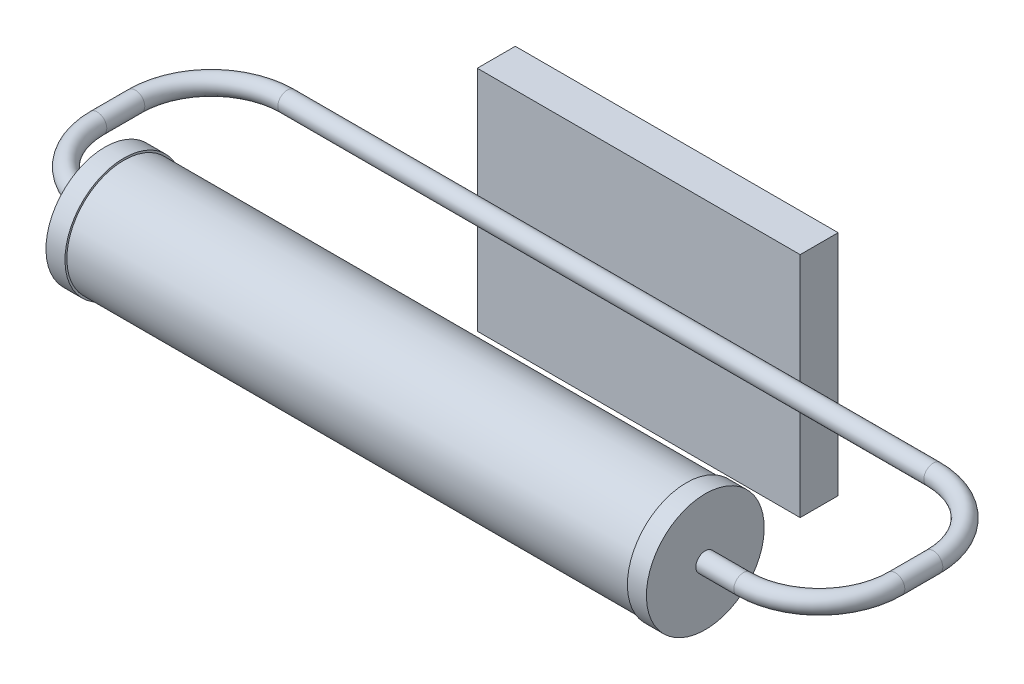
ISO-10303-21;
HEADER;
FILE_DESCRIPTION(('STEP AP214'),'2;1');
FILE_NAME('part.step','',(''),(''),'','','');
FILE_SCHEMA(('AUTOMOTIVE_DESIGN { 1 0 10303 214 1 1 1 1 }'));
ENDSEC;
DATA;
#1=APPLICATION_CONTEXT('core data for automotive mechanical design processes');
#2=APPLICATION_PROTOCOL_DEFINITION('international standard','automotive_design',2000,#1);
#3=PRODUCT_CONTEXT('',#1,'mechanical');
#4=PRODUCT('Part','Part','',(#3));
#5=PRODUCT_RELATED_PRODUCT_CATEGORY('part','',(#4));
#6=PRODUCT_DEFINITION_FORMATION('','',#4);
#7=PRODUCT_DEFINITION_CONTEXT('part definition',#1,'design');
#8=PRODUCT_DEFINITION('design','',#6,#7);
#9=PRODUCT_DEFINITION_SHAPE('','',#8);
#10=(LENGTH_UNIT() NAMED_UNIT(*) SI_UNIT(.MILLI.,.METRE.));
#11=(NAMED_UNIT(*) PLANE_ANGLE_UNIT() SI_UNIT($,.RADIAN.));
#12=(NAMED_UNIT(*) SI_UNIT($,.STERADIAN.) SOLID_ANGLE_UNIT());
#13=UNCERTAINTY_MEASURE_WITH_UNIT(LENGTH_MEASURE(1.E-05),#10,'distance_accuracy_value','');
#14=(GEOMETRIC_REPRESENTATION_CONTEXT(3) GLOBAL_UNCERTAINTY_ASSIGNED_CONTEXT((#13)) GLOBAL_UNIT_ASSIGNED_CONTEXT((#10,
#11,#12)) REPRESENTATION_CONTEXT('',''));
#15=CARTESIAN_POINT('',(0.,0.,0.));
#16=DIRECTION('',(0.,0.,1.));
#17=DIRECTION('',(1.,0.,0.));
#18=AXIS2_PLACEMENT_3D('',#15,#16,#17);
#19=CARTESIAN_POINT('',(-31.,59.944,-125.));
#20=DIRECTION('',(1.,0.,0.));
#21=DIRECTION('',(0.,1.,0.));
#22=AXIS2_PLACEMENT_3D('',#19,#20,#21);
#23=PLANE('',#22);
#24=DIRECTION('',(0.,1.,0.));
#25=VECTOR('',#24,1.);
#26=CARTESIAN_POINT('',(-31.,59.944,-105.));
#27=LINE('',#26,#25);
#28=CARTESIAN_POINT('',(-31.,-59.944,-105.));
#29=VERTEX_POINT('',#28);
#30=CARTESIAN_POINT('',(-31.,59.944,-105.));
#31=VERTEX_POINT('',#30);
#32=EDGE_CURVE('E192',#29,#31,#27,.T.);
#33=ORIENTED_EDGE('',*,*,#32,.T.);
#34=DIRECTION('',(0.,0.,1.));
#35=VECTOR('',#34,1.);
#36=CARTESIAN_POINT('',(-31.,59.944,-125.));
#37=LINE('',#36,#35);
#38=CARTESIAN_POINT('',(-31.,59.944,-125.));
#39=VERTEX_POINT('',#38);
#40=EDGE_CURVE('E13',#39,#31,#37,.T.);
#41=ORIENTED_EDGE('',*,*,#40,.F.);
#42=DIRECTION('',(0.,1.,0.));
#43=VECTOR('',#42,1.);
#44=CARTESIAN_POINT('',(-31.,59.944,-125.));
#45=LINE('',#44,#43);
#46=CARTESIAN_POINT('',(-31.,-59.944,-125.));
#47=VERTEX_POINT('',#46);
#48=EDGE_CURVE('E185',#47,#39,#45,.T.);
#49=ORIENTED_EDGE('',*,*,#48,.F.);
#50=DIRECTION('',(0.,0.,1.));
#51=VECTOR('',#50,1.);
#52=CARTESIAN_POINT('',(-31.,-59.944,-125.));
#53=LINE('',#52,#51);
#54=EDGE_CURVE('E191',#47,#29,#53,.T.);
#55=ORIENTED_EDGE('',*,*,#54,.T.);
#56=EDGE_LOOP('',(#33,#41,#49,#55));
#57=FACE_BOUND('',#56,.T.);
#58=ADVANCED_FACE('F78',(#57),#23,.F.);
#59=CARTESIAN_POINT('',(138.926,59.944,-125.));
#60=DIRECTION('',(0.,-1.,0.));
#61=DIRECTION('',(0.,0.,-1.));
#62=AXIS2_PLACEMENT_3D('',#59,#60,#61);
#63=PLANE('',#62);
#64=DIRECTION('',(1.,0.,0.));
#65=VECTOR('',#64,1.);
#66=CARTESIAN_POINT('',(138.926,59.944,-105.));
#67=LINE('',#66,#65);
#68=CARTESIAN_POINT('',(138.926,59.944,-105.));
#69=VERTEX_POINT('',#68);
#70=EDGE_CURVE('E195',#31,#69,#67,.T.);
#71=ORIENTED_EDGE('',*,*,#70,.T.);
#72=DIRECTION('',(0.,0.,1.));
#73=VECTOR('',#72,1.);
#74=CARTESIAN_POINT('',(138.926,59.944,-125.));
#75=LINE('',#74,#73);
#76=CARTESIAN_POINT('',(138.926,59.944,-125.));
#77=VERTEX_POINT('',#76);
#78=EDGE_CURVE('E85',#77,#69,#75,.T.);
#79=ORIENTED_EDGE('',*,*,#78,.F.);
#80=DIRECTION('',(1.,0.,0.));
#81=VECTOR('',#80,1.);
#82=CARTESIAN_POINT('',(138.926,59.944,-125.));
#83=LINE('',#82,#81);
#84=EDGE_CURVE('E129',#39,#77,#83,.T.);
#85=ORIENTED_EDGE('',*,*,#84,.F.);
#86=ORIENTED_EDGE('',*,*,#40,.T.);
#87=EDGE_LOOP('',(#71,#79,#85,#86));
#88=FACE_BOUND('',#87,.T.);
#89=ADVANCED_FACE('F224',(#88),#63,.F.);
#90=CARTESIAN_POINT('',(138.926,59.944,-125.));
#91=DIRECTION('',(-1.,0.,0.));
#92=DIRECTION('',(0.,0.,1.));
#93=AXIS2_PLACEMENT_3D('',#90,#91,#92);
#94=PLANE('',#93);
#95=DIRECTION('',(0.,-1.,0.));
#96=VECTOR('',#95,1.);
#97=CARTESIAN_POINT('',(138.926,59.944,-105.));
#98=LINE('',#97,#96);
#99=CARTESIAN_POINT('',(138.926,-59.944,-105.));
#100=VERTEX_POINT('',#99);
#101=EDGE_CURVE('E197',#69,#100,#98,.T.);
#102=ORIENTED_EDGE('',*,*,#101,.T.);
#103=DIRECTION('',(0.,0.,1.));
#104=VECTOR('',#103,1.);
#105=CARTESIAN_POINT('',(138.926,-59.944,-125.));
#106=LINE('',#105,#104);
#107=CARTESIAN_POINT('',(138.926,-59.944,-125.));
#108=VERTEX_POINT('',#107);
#109=EDGE_CURVE('E201',#108,#100,#106,.T.);
#110=ORIENTED_EDGE('',*,*,#109,.F.);
#111=DIRECTION('',(0.,-1.,0.));
#112=VECTOR('',#111,1.);
#113=CARTESIAN_POINT('',(138.926,59.944,-125.));
#114=LINE('',#113,#112);
#115=EDGE_CURVE('E188',#77,#108,#114,.T.);
#116=ORIENTED_EDGE('',*,*,#115,.F.);
#117=ORIENTED_EDGE('',*,*,#78,.T.);
#118=EDGE_LOOP('',(#102,#110,#116,#117));
#119=FACE_BOUND('',#118,.T.);
#120=ADVANCED_FACE('F206',(#119),#94,.F.);
#121=CARTESIAN_POINT('',(138.926,-59.944,-125.));
#122=DIRECTION('',(0.,1.,0.));
#123=DIRECTION('',(0.,0.,1.));
#124=AXIS2_PLACEMENT_3D('',#121,#122,#123);
#125=PLANE('',#124);
#126=DIRECTION('',(-1.,0.,0.));
#127=VECTOR('',#126,1.);
#128=CARTESIAN_POINT('',(138.926,-59.944,-105.));
#129=LINE('',#128,#127);
#130=EDGE_CURVE('E122',#100,#29,#129,.T.);
#131=ORIENTED_EDGE('',*,*,#130,.T.);
#132=ORIENTED_EDGE('',*,*,#54,.F.);
#133=DIRECTION('',(-1.,0.,0.));
#134=VECTOR('',#133,1.);
#135=CARTESIAN_POINT('',(138.926,-59.944,-125.));
#136=LINE('',#135,#134);
#137=EDGE_CURVE('E101',#108,#47,#136,.T.);
#138=ORIENTED_EDGE('',*,*,#137,.F.);
#139=ORIENTED_EDGE('',*,*,#109,.T.);
#140=EDGE_LOOP('',(#131,#132,#138,#139));
#141=FACE_BOUND('',#140,.T.);
#142=ADVANCED_FACE('F214',(#141),#125,.F.);
#143=CARTESIAN_POINT('',(0.,0.,-125.));
#144=DIRECTION('',(0.,0.,-1.));
#145=DIRECTION('',(-1.,0.,0.));
#146=AXIS2_PLACEMENT_3D('',#143,#144,#145);
#147=PLANE('',#146);
#148=DIRECTION('',(0.,1.,0.));
#149=VECTOR('',#148,1.);
#150=CARTESIAN_POINT('',(-30.,59.944,-125.));
#151=LINE('',#150,#149);
#152=CARTESIAN_POINT('',(-30.,-58.944,-125.));
#153=VERTEX_POINT('',#152);
#154=CARTESIAN_POINT('',(-30.,58.944,-125.));
#155=VERTEX_POINT('',#154);
#156=EDGE_CURVE('E174',#153,#155,#151,.T.);
#157=ORIENTED_EDGE('',*,*,#156,.F.);
#158=DIRECTION('',(-1.,0.,0.));
#159=VECTOR('',#158,1.);
#160=CARTESIAN_POINT('',(138.926,-58.944,-125.));
#161=LINE('',#160,#159);
#162=CARTESIAN_POINT('',(137.926,-58.944,-125.));
#163=VERTEX_POINT('',#162);
#164=EDGE_CURVE('E183',#163,#153,#161,.T.);
#165=ORIENTED_EDGE('',*,*,#164,.F.);
#166=DIRECTION('',(0.,-1.,0.));
#167=VECTOR('',#166,1.);
#168=CARTESIAN_POINT('',(137.926,59.944,-125.));
#169=LINE('',#168,#167);
#170=CARTESIAN_POINT('',(137.926,58.944,-125.));
#171=VERTEX_POINT('',#170);
#172=EDGE_CURVE('E181',#171,#163,#169,.T.);
#173=ORIENTED_EDGE('',*,*,#172,.F.);
#174=DIRECTION('',(1.,0.,0.));
#175=VECTOR('',#174,1.);
#176=CARTESIAN_POINT('',(138.926,58.944,-125.));
#177=LINE('',#176,#175);
#178=EDGE_CURVE('E166',#155,#171,#177,.T.);
#179=ORIENTED_EDGE('',*,*,#178,.F.);
#180=EDGE_LOOP('',(#157,#165,#173,#179));
#181=FACE_BOUND('',#180,.T.);
#182=ORIENTED_EDGE('',*,*,#48,.T.);
#183=ORIENTED_EDGE('',*,*,#84,.T.);
#184=ORIENTED_EDGE('',*,*,#115,.T.);
#185=ORIENTED_EDGE('',*,*,#137,.T.);
#186=EDGE_LOOP('',(#182,#183,#184,#185));
#187=FACE_BOUND('',#186,.T.);
#188=ADVANCED_FACE('F216',(#181,#187),#147,.T.);
#189=CARTESIAN_POINT('',(0.,0.,-105.));
#190=DIRECTION('',(0.,0.,-1.));
#191=DIRECTION('',(-1.,0.,0.));
#192=AXIS2_PLACEMENT_3D('',#189,#190,#191);
#193=PLANE('',#192);
#194=ORIENTED_EDGE('',*,*,#32,.F.);
#195=ORIENTED_EDGE('',*,*,#130,.F.);
#196=ORIENTED_EDGE('',*,*,#101,.F.);
#197=ORIENTED_EDGE('',*,*,#70,.F.);
#198=EDGE_LOOP('',(#194,#195,#196,#197));
#199=FACE_BOUND('',#198,.T.);
#200=ADVANCED_FACE('F210',(#199),#193,.F.);
#201=CARTESIAN_POINT('',(-30.,59.944,-125.));
#202=DIRECTION('',(1.,0.,0.));
#203=DIRECTION('',(0.,1.,0.));
#204=AXIS2_PLACEMENT_3D('',#201,#202,#203);
#205=PLANE('',#204);
#206=DIRECTION('',(0.,1.,0.));
#207=VECTOR('',#206,1.);
#208=CARTESIAN_POINT('',(-30.,59.944,-106.));
#209=LINE('',#208,#207);
#210=CARTESIAN_POINT('',(-30.,-58.944,-106.));
#211=VERTEX_POINT('',#210);
#212=CARTESIAN_POINT('',(-30.,58.944,-106.));
#213=VERTEX_POINT('',#212);
#214=EDGE_CURVE('E157',#211,#213,#209,.T.);
#215=ORIENTED_EDGE('',*,*,#214,.F.);
#216=DIRECTION('',(0.,0.,1.));
#217=VECTOR('',#216,1.);
#218=CARTESIAN_POINT('',(-30.,-58.944,-125.));
#219=LINE('',#218,#217);
#220=EDGE_CURVE('E177',#153,#211,#219,.T.);
#221=ORIENTED_EDGE('',*,*,#220,.F.);
#222=ORIENTED_EDGE('',*,*,#156,.T.);
#223=DIRECTION('',(0.,0.,1.));
#224=VECTOR('',#223,1.);
#225=CARTESIAN_POINT('',(-30.,58.944,-125.));
#226=LINE('',#225,#224);
#227=EDGE_CURVE('E169',#155,#213,#226,.T.);
#228=ORIENTED_EDGE('',*,*,#227,.T.);
#229=EDGE_LOOP('',(#215,#221,#222,#228));
#230=FACE_BOUND('',#229,.T.);
#231=ADVANCED_FACE('F253',(#230),#205,.T.);
#232=CARTESIAN_POINT('',(138.926,58.944,-125.));
#233=DIRECTION('',(0.,-1.,0.));
#234=DIRECTION('',(0.,0.,-1.));
#235=AXIS2_PLACEMENT_3D('',#232,#233,#234);
#236=PLANE('',#235);
#237=DIRECTION('',(1.,0.,0.));
#238=VECTOR('',#237,1.);
#239=CARTESIAN_POINT('',(138.926,58.944,-106.));
#240=LINE('',#239,#238);
#241=CARTESIAN_POINT('',(137.926,58.944,-106.));
#242=VERTEX_POINT('',#241);
#243=EDGE_CURVE('E151',#213,#242,#240,.T.);
#244=ORIENTED_EDGE('',*,*,#243,.F.);
#245=ORIENTED_EDGE('',*,*,#227,.F.);
#246=ORIENTED_EDGE('',*,*,#178,.T.);
#247=DIRECTION('',(0.,0.,1.));
#248=VECTOR('',#247,1.);
#249=CARTESIAN_POINT('',(137.926,58.944,-125.));
#250=LINE('',#249,#248);
#251=EDGE_CURVE('E163',#171,#242,#250,.T.);
#252=ORIENTED_EDGE('',*,*,#251,.T.);
#253=EDGE_LOOP('',(#244,#245,#246,#252));
#254=FACE_BOUND('',#253,.T.);
#255=ADVANCED_FACE('F164',(#254),#236,.T.);
#256=CARTESIAN_POINT('',(137.926,59.944,-125.));
#257=DIRECTION('',(-1.,0.,0.));
#258=DIRECTION('',(0.,0.,1.));
#259=AXIS2_PLACEMENT_3D('',#256,#257,#258);
#260=PLANE('',#259);
#261=DIRECTION('',(0.,-1.,0.));
#262=VECTOR('',#261,1.);
#263=CARTESIAN_POINT('',(137.926,59.944,-106.));
#264=LINE('',#263,#262);
#265=CARTESIAN_POINT('',(137.926,-58.944,-106.));
#266=VERTEX_POINT('',#265);
#267=EDGE_CURVE('E155',#242,#266,#264,.T.);
#268=ORIENTED_EDGE('',*,*,#267,.F.);
#269=ORIENTED_EDGE('',*,*,#251,.F.);
#270=ORIENTED_EDGE('',*,*,#172,.T.);
#271=DIRECTION('',(0.,0.,1.));
#272=VECTOR('',#271,1.);
#273=CARTESIAN_POINT('',(137.926,-58.944,-125.));
#274=LINE('',#273,#272);
#275=EDGE_CURVE('E92',#163,#266,#274,.T.);
#276=ORIENTED_EDGE('',*,*,#275,.T.);
#277=EDGE_LOOP('',(#268,#269,#270,#276));
#278=FACE_BOUND('',#277,.T.);
#279=ADVANCED_FACE('F171',(#278),#260,.T.);
#280=CARTESIAN_POINT('',(138.926,-58.944,-125.));
#281=DIRECTION('',(0.,1.,0.));
#282=DIRECTION('',(0.,0.,1.));
#283=AXIS2_PLACEMENT_3D('',#280,#281,#282);
#284=PLANE('',#283);
#285=DIRECTION('',(-1.,0.,0.));
#286=VECTOR('',#285,1.);
#287=CARTESIAN_POINT('',(138.926,-58.944,-106.));
#288=LINE('',#287,#286);
#289=EDGE_CURVE('E172',#266,#211,#288,.T.);
#290=ORIENTED_EDGE('',*,*,#289,.F.);
#291=ORIENTED_EDGE('',*,*,#275,.F.);
#292=ORIENTED_EDGE('',*,*,#164,.T.);
#293=ORIENTED_EDGE('',*,*,#220,.T.);
#294=EDGE_LOOP('',(#290,#291,#292,#293));
#295=FACE_BOUND('',#294,.T.);
#296=ADVANCED_FACE('F287',(#295),#284,.T.);
#297=CARTESIAN_POINT('',(0.,0.,-106.));
#298=DIRECTION('',(0.,0.,-1.));
#299=DIRECTION('',(-1.,0.,0.));
#300=AXIS2_PLACEMENT_3D('',#297,#298,#299);
#301=PLANE('',#300);
#302=ORIENTED_EDGE('',*,*,#214,.T.);
#303=ORIENTED_EDGE('',*,*,#243,.T.);
#304=ORIENTED_EDGE('',*,*,#267,.T.);
#305=ORIENTED_EDGE('',*,*,#289,.T.);
#306=EDGE_LOOP('',(#302,#303,#304,#305));
#307=FACE_BOUND('',#306,.T.);
#308=ADVANCED_FACE('F153',(#307),#301,.T.);
#309=CLOSED_SHELL('',(#58,#89,#120,#142,#188,#200,#231,#255,#279,#296,#308));
#310=MANIFOLD_SOLID_BREP('B2',#309);
#311=CARTESIAN_POINT('',(194.,0.,0.));
#312=DIRECTION('',(-1.,0.,0.));
#313=DIRECTION('',(0.,0.,1.));
#314=AXIS2_PLACEMENT_3D('',#311,#312,#313);
#315=PLANE('',#314);
#316=CARTESIAN_POINT('',(194.,0.,0.));
#317=DIRECTION('',(-1.,0.,0.));
#318=DIRECTION('',(0.,0.,1.));
#319=AXIS2_PLACEMENT_3D('',#316,#317,#318);
#320=CIRCLE('',#319,5.);
#321=CARTESIAN_POINT('',(194.,0.,5.));
#322=VERTEX_POINT('',#321);
#323=EDGE_CURVE('E359',#322,#322,#320,.T.);
#324=ORIENTED_EDGE('',*,*,#323,.T.);
#325=EDGE_LOOP('',(#324));
#326=FACE_BOUND('',#325,.T.);
#327=ADVANCED_FACE('F347',(#326),#315,.T.);
#328=CARTESIAN_POINT('',(-122.,0.,0.));
#329=DIRECTION('',(-1.,0.,0.));
#330=DIRECTION('',(0.,0.,1.));
#331=AXIS2_PLACEMENT_3D('',#328,#329,#330);
#332=PLANE('',#331);
#333=CARTESIAN_POINT('',(-122.,0.,0.));
#334=DIRECTION('',(-1.,0.,0.));
#335=DIRECTION('',(0.,0.,1.));
#336=AXIS2_PLACEMENT_3D('',#333,#334,#335);
#337=CIRCLE('',#336,5.);
#338=CARTESIAN_POINT('',(-122.,0.,5.));
#339=VERTEX_POINT('',#338);
#340=EDGE_CURVE('E76',#339,#339,#337,.T.);
#341=ORIENTED_EDGE('',*,*,#340,.F.);
#342=EDGE_LOOP('',(#341));
#343=FACE_BOUND('',#342,.T.);
#344=ADVANCED_FACE('F365',(#343),#332,.F.);
#345=CARTESIAN_POINT('',(194.,0.,0.));
#346=DIRECTION('',(1.,0.,0.));
#347=DIRECTION('',(0.,0.,-1.));
#348=AXIS2_PLACEMENT_3D('',#345,#346,#347);
#349=CYLINDRICAL_SURFACE('',#348,5.);
#350=CARTESIAN_POINT('',(214.,0.,0.));
#351=DIRECTION('',(-1.,0.,0.));
#352=DIRECTION('',(0.,0.,1.));
#353=AXIS2_PLACEMENT_3D('',#350,#351,#352);
#354=CIRCLE('',#353,5.);
#355=CARTESIAN_POINT('',(214.,0.,5.));
#356=VERTEX_POINT('',#355);
#357=EDGE_CURVE('E415',#356,#356,#354,.T.);
#358=ORIENTED_EDGE('',*,*,#357,.T.);
#359=EDGE_LOOP('',(#358));
#360=FACE_BOUND('',#359,.T.);
#361=ORIENTED_EDGE('',*,*,#323,.F.);
#362=EDGE_LOOP('',(#361));
#363=FACE_BOUND('',#362,.T.);
#364=ADVANCED_FACE('F367',(#360,#363),#349,.T.);
#365=CARTESIAN_POINT('',(214.,0.,-40.));
#366=DIRECTION('',(0.,1.,0.));
#367=DIRECTION('',(0.,0.,1.));
#368=AXIS2_PLACEMENT_3D('',#365,#366,#367);
#369=TOROIDAL_SURFACE('',#368,40.,5.);
#370=CARTESIAN_POINT('',(254.,0.,-40.));
#371=DIRECTION('',(0.,0.,1.));
#372=DIRECTION('',(1.,0.,0.));
#373=AXIS2_PLACEMENT_3D('',#370,#371,#372);
#374=CIRCLE('',#373,5.);
#375=CARTESIAN_POINT('',(259.,0.,-40.));
#376=VERTEX_POINT('',#375);
#377=EDGE_CURVE('E412',#376,#376,#374,.T.);
#378=CARTESIAN_POINT('',(214.,0.,-40.));
#379=DIRECTION('',(0.,1.,0.));
#380=DIRECTION('',(0.,0.,1.));
#381=AXIS2_PLACEMENT_3D('',#378,#379,#380);
#382=CIRCLE('',#381,45.);
#383=EDGE_CURVE('',#356,#376,#382,.T.);
#384=ORIENTED_EDGE('',*,*,#357,.F.);
#385=ORIENTED_EDGE('',*,*,#377,.T.);
#386=ORIENTED_EDGE('',*,*,#383,.T.);
#387=ORIENTED_EDGE('',*,*,#383,.F.);
#388=EDGE_LOOP('',(#384,#386,#385,#387));
#389=FACE_BOUND('',#388,.T.);
#390=ADVANCED_FACE('F372',(#389),#369,.T.);
#391=CARTESIAN_POINT('',(254.,0.,-40.));
#392=DIRECTION('',(0.,0.,-1.));
#393=DIRECTION('',(-1.,0.,0.));
#394=AXIS2_PLACEMENT_3D('',#391,#392,#393);
#395=CYLINDRICAL_SURFACE('',#394,5.);
#396=CARTESIAN_POINT('',(254.,0.,-60.));
#397=DIRECTION('',(0.,0.,1.));
#398=DIRECTION('',(1.,0.,0.));
#399=AXIS2_PLACEMENT_3D('',#396,#397,#398);
#400=CIRCLE('',#399,5.);
#401=CARTESIAN_POINT('',(259.,0.,-60.));
#402=VERTEX_POINT('',#401);
#403=EDGE_CURVE('E417',#402,#402,#400,.T.);
#404=ORIENTED_EDGE('',*,*,#403,.T.);
#405=EDGE_LOOP('',(#404));
#406=FACE_BOUND('',#405,.T.);
#407=ORIENTED_EDGE('',*,*,#377,.F.);
#408=EDGE_LOOP('',(#407));
#409=FACE_BOUND('',#408,.T.);
#410=ADVANCED_FACE('F400',(#406,#409),#395,.T.);
#411=CARTESIAN_POINT('',(214.,0.,-60.));
#412=DIRECTION('',(0.,1.,0.));
#413=DIRECTION('',(0.,0.,1.));
#414=AXIS2_PLACEMENT_3D('',#411,#412,#413);
#415=TOROIDAL_SURFACE('',#414,40.,5.);
#416=CARTESIAN_POINT('',(214.,0.,-100.));
#417=DIRECTION('',(1.,0.,0.));
#418=DIRECTION('',(0.,0.,-1.));
#419=AXIS2_PLACEMENT_3D('',#416,#417,#418);
#420=CIRCLE('',#419,5.);
#421=CARTESIAN_POINT('',(214.,0.,-105.));
#422=VERTEX_POINT('',#421);
#423=EDGE_CURVE('E423',#422,#422,#420,.T.);
#424=CARTESIAN_POINT('',(214.,0.,-60.));
#425=DIRECTION('',(0.,1.,0.));
#426=DIRECTION('',(0.,0.,1.));
#427=AXIS2_PLACEMENT_3D('',#424,#425,#426);
#428=CIRCLE('',#427,45.);
#429=EDGE_CURVE('',#402,#422,#428,.T.);
#430=ORIENTED_EDGE('',*,*,#403,.F.);
#431=ORIENTED_EDGE('',*,*,#423,.T.);
#432=ORIENTED_EDGE('',*,*,#429,.T.);
#433=ORIENTED_EDGE('',*,*,#429,.F.);
#434=EDGE_LOOP('',(#430,#432,#431,#433));
#435=FACE_BOUND('',#434,.T.);
#436=ADVANCED_FACE('F396',(#435),#415,.T.);
#437=CARTESIAN_POINT('',(214.,0.,-100.));
#438=DIRECTION('',(-1.,0.,0.));
#439=DIRECTION('',(0.,0.,1.));
#440=AXIS2_PLACEMENT_3D('',#437,#438,#439);
#441=CYLINDRICAL_SURFACE('',#440,5.);
#442=CARTESIAN_POINT('',(-126.,0.,-100.));
#443=DIRECTION('',(1.,0.,0.));
#444=DIRECTION('',(0.,0.,-1.));
#445=AXIS2_PLACEMENT_3D('',#442,#443,#444);
#446=CIRCLE('',#445,5.);
#447=CARTESIAN_POINT('',(-126.,0.,-105.));
#448=VERTEX_POINT('',#447);
#449=EDGE_CURVE('E426',#448,#448,#446,.T.);
#450=ORIENTED_EDGE('',*,*,#449,.T.);
#451=EDGE_LOOP('',(#450));
#452=FACE_BOUND('',#451,.T.);
#453=ORIENTED_EDGE('',*,*,#423,.F.);
#454=EDGE_LOOP('',(#453));
#455=FACE_BOUND('',#454,.T.);
#456=ADVANCED_FACE('F392',(#452,#455),#441,.T.);
#457=CARTESIAN_POINT('',(-126.,0.,-60.));
#458=DIRECTION('',(0.,1.,0.));
#459=DIRECTION('',(0.,0.,1.));
#460=AXIS2_PLACEMENT_3D('',#457,#458,#459);
#461=TOROIDAL_SURFACE('',#460,40.,5.);
#462=CARTESIAN_POINT('',(-166.,0.,-60.));
#463=DIRECTION('',(0.,0.,-1.));
#464=DIRECTION('',(-1.,0.,0.));
#465=AXIS2_PLACEMENT_3D('',#462,#463,#464);
#466=CIRCLE('',#465,5.);
#467=CARTESIAN_POINT('',(-171.,0.,-60.));
#468=VERTEX_POINT('',#467);
#469=EDGE_CURVE('E429',#468,#468,#466,.T.);
#470=CARTESIAN_POINT('',(-126.,0.,-60.));
#471=DIRECTION('',(0.,1.,0.));
#472=DIRECTION('',(0.,0.,1.));
#473=AXIS2_PLACEMENT_3D('',#470,#471,#472);
#474=CIRCLE('',#473,45.);
#475=EDGE_CURVE('',#448,#468,#474,.T.);
#476=ORIENTED_EDGE('',*,*,#449,.F.);
#477=ORIENTED_EDGE('',*,*,#469,.T.);
#478=ORIENTED_EDGE('',*,*,#475,.T.);
#479=ORIENTED_EDGE('',*,*,#475,.F.);
#480=EDGE_LOOP('',(#476,#478,#477,#479));
#481=FACE_BOUND('',#480,.T.);
#482=ADVANCED_FACE('F388',(#481),#461,.T.);
#483=CARTESIAN_POINT('',(-166.,0.,-60.));
#484=DIRECTION('',(0.,0.,1.));
#485=DIRECTION('',(1.,0.,0.));
#486=AXIS2_PLACEMENT_3D('',#483,#484,#485);
#487=CYLINDRICAL_SURFACE('',#486,5.);
#488=CARTESIAN_POINT('',(-166.,0.,-40.));
#489=DIRECTION('',(0.,0.,-1.));
#490=DIRECTION('',(-1.,0.,0.));
#491=AXIS2_PLACEMENT_3D('',#488,#489,#490);
#492=CIRCLE('',#491,5.);
#493=CARTESIAN_POINT('',(-171.,0.,-40.));
#494=VERTEX_POINT('',#493);
#495=EDGE_CURVE('E432',#494,#494,#492,.T.);
#496=ORIENTED_EDGE('',*,*,#495,.T.);
#497=EDGE_LOOP('',(#496));
#498=FACE_BOUND('',#497,.T.);
#499=ORIENTED_EDGE('',*,*,#469,.F.);
#500=EDGE_LOOP('',(#499));
#501=FACE_BOUND('',#500,.T.);
#502=ADVANCED_FACE('F382',(#498,#501),#487,.T.);
#503=CARTESIAN_POINT('',(-126.,0.,-40.));
#504=DIRECTION('',(0.,1.,0.));
#505=DIRECTION('',(0.,0.,1.));
#506=AXIS2_PLACEMENT_3D('',#503,#504,#505);
#507=TOROIDAL_SURFACE('',#506,40.,5.);
#508=CARTESIAN_POINT('',(-126.,0.,0.));
#509=DIRECTION('',(-1.,0.,0.));
#510=DIRECTION('',(0.,0.,1.));
#511=AXIS2_PLACEMENT_3D('',#508,#509,#510);
#512=CIRCLE('',#511,5.);
#513=CARTESIAN_POINT('',(-126.,0.,5.));
#514=VERTEX_POINT('',#513);
#515=EDGE_CURVE('E354',#514,#514,#512,.T.);
#516=CARTESIAN_POINT('',(-126.,0.,-40.));
#517=DIRECTION('',(0.,1.,0.));
#518=DIRECTION('',(0.,0.,1.));
#519=AXIS2_PLACEMENT_3D('',#516,#517,#518);
#520=CIRCLE('',#519,45.);
#521=EDGE_CURVE('',#494,#514,#520,.T.);
#522=ORIENTED_EDGE('',*,*,#495,.F.);
#523=ORIENTED_EDGE('',*,*,#515,.T.);
#524=ORIENTED_EDGE('',*,*,#521,.T.);
#525=ORIENTED_EDGE('',*,*,#521,.F.);
#526=EDGE_LOOP('',(#522,#524,#523,#525));
#527=FACE_BOUND('',#526,.T.);
#528=ADVANCED_FACE('F378',(#527),#507,.T.);
#529=CARTESIAN_POINT('',(-126.,0.,0.));
#530=DIRECTION('',(1.,0.,0.));
#531=DIRECTION('',(0.,0.,-1.));
#532=AXIS2_PLACEMENT_3D('',#529,#530,#531);
#533=CYLINDRICAL_SURFACE('',#532,5.);
#534=ORIENTED_EDGE('',*,*,#340,.T.);
#535=EDGE_LOOP('',(#534));
#536=FACE_BOUND('',#535,.T.);
#537=ORIENTED_EDGE('',*,*,#515,.F.);
#538=EDGE_LOOP('',(#537));
#539=FACE_BOUND('',#538,.T.);
#540=ADVANCED_FACE('F362',(#536,#539),#533,.T.);
#541=CLOSED_SHELL('',(#327,#344,#364,#390,#410,#436,#456,#482,#502,#528,#540));
#542=MANIFOLD_SOLID_BREP('B7',#541);
#543=CARTESIAN_POINT('',(184.,0.,0.));
#544=DIRECTION('',(1.,0.,0.));
#545=DIRECTION('',(0.,-1.,0.));
#546=AXIS2_PLACEMENT_3D('',#543,#544,#545);
#547=CYLINDRICAL_SURFACE('',#546,31.);
#548=CARTESIAN_POINT('',(184.,0.,0.));
#549=DIRECTION('',(1.,0.,0.));
#550=DIRECTION('',(0.,1.,0.));
#551=AXIS2_PLACEMENT_3D('',#548,#549,#550);
#552=CIRCLE('',#551,31.);
#553=CARTESIAN_POINT('',(184.,31.,0.));
#554=VERTEX_POINT('',#553);
#555=EDGE_CURVE('E346',#554,#554,#552,.T.);
#556=ORIENTED_EDGE('',*,*,#555,.T.);
#557=EDGE_LOOP('',(#556));
#558=FACE_BOUND('',#557,.T.);
#559=CARTESIAN_POINT('',(194.,0.,0.));
#560=DIRECTION('',(1.,0.,0.));
#561=DIRECTION('',(0.,1.,0.));
#562=AXIS2_PLACEMENT_3D('',#559,#560,#561);
#563=CIRCLE('',#562,31.);
#564=CARTESIAN_POINT('',(194.,31.,0.));
#565=VERTEX_POINT('',#564);
#566=EDGE_CURVE('E521',#565,#565,#563,.T.);
#567=ORIENTED_EDGE('',*,*,#566,.F.);
#568=EDGE_LOOP('',(#567));
#569=FACE_BOUND('',#568,.T.);
#570=ADVANCED_FACE('F518',(#558,#569),#547,.T.);
#571=CARTESIAN_POINT('',(184.,0.,0.));
#572=DIRECTION('',(-1.,0.,0.));
#573=DIRECTION('',(0.,1.,0.));
#574=AXIS2_PLACEMENT_3D('',#571,#572,#573);
#575=PLANE('',#574);
#576=CARTESIAN_POINT('',(184.,0.,0.));
#577=DIRECTION('',(1.,0.,0.));
#578=DIRECTION('',(0.,1.,0.));
#579=AXIS2_PLACEMENT_3D('',#576,#577,#578);
#580=CIRCLE('',#579,30.);
#581=CARTESIAN_POINT('',(184.,30.,0.));
#582=VERTEX_POINT('',#581);
#583=EDGE_CURVE('E530',#582,#582,#580,.T.);
#584=ORIENTED_EDGE('',*,*,#583,.T.);
#585=EDGE_LOOP('',(#584));
#586=FACE_BOUND('',#585,.T.);
#587=ORIENTED_EDGE('',*,*,#555,.F.);
#588=EDGE_LOOP('',(#587));
#589=FACE_BOUND('',#588,.T.);
#590=ADVANCED_FACE('F548',(#586,#589),#575,.T.);
#591=CARTESIAN_POINT('',(194.,0.,0.));
#592=DIRECTION('',(-1.,0.,0.));
#593=DIRECTION('',(0.,1.,0.));
#594=AXIS2_PLACEMENT_3D('',#591,#592,#593);
#595=PLANE('',#594);
#596=ORIENTED_EDGE('',*,*,#566,.T.);
#597=EDGE_LOOP('',(#596));
#598=FACE_BOUND('',#597,.T.);
#599=ADVANCED_FACE('F545',(#598),#595,.F.);
#600=CARTESIAN_POINT('',(186.,0.,0.));
#601=DIRECTION('',(-1.,0.,0.));
#602=DIRECTION('',(0.,1.,0.));
#603=AXIS2_PLACEMENT_3D('',#600,#601,#602);
#604=CYLINDRICAL_SURFACE('',#603,30.);
#605=CARTESIAN_POINT('',(186.,0.,0.));
#606=DIRECTION('',(1.,0.,0.));
#607=DIRECTION('',(0.,1.,0.));
#608=AXIS2_PLACEMENT_3D('',#605,#606,#607);
#609=CIRCLE('',#608,30.);
#610=CARTESIAN_POINT('',(186.,30.,0.));
#611=VERTEX_POINT('',#610);
#612=EDGE_CURVE('E528',#611,#611,#609,.T.);
#613=ORIENTED_EDGE('',*,*,#612,.T.);
#614=EDGE_LOOP('',(#613));
#615=FACE_BOUND('',#614,.T.);
#616=ORIENTED_EDGE('',*,*,#583,.F.);
#617=EDGE_LOOP('',(#616));
#618=FACE_BOUND('',#617,.T.);
#619=ADVANCED_FACE('F536',(#615,#618),#604,.F.);
#620=CARTESIAN_POINT('',(186.,0.,0.));
#621=DIRECTION('',(-1.,0.,0.));
#622=DIRECTION('',(0.,1.,0.));
#623=AXIS2_PLACEMENT_3D('',#620,#621,#622);
#624=PLANE('',#623);
#625=ORIENTED_EDGE('',*,*,#612,.F.);
#626=EDGE_LOOP('',(#625));
#627=FACE_BOUND('',#626,.T.);
#628=ADVANCED_FACE('F539',(#627),#624,.T.);
#629=CLOSED_SHELL('',(#570,#590,#599,#619,#628));
#630=MANIFOLD_SOLID_BREP('B70',#629);
#631=CARTESIAN_POINT('',(186.,0.,0.));
#632=DIRECTION('',(1.,0.,0.));
#633=DIRECTION('',(0.,1.,0.));
#634=AXIS2_PLACEMENT_3D('',#631,#632,#633);
#635=PLANE('',#634);
#636=CARTESIAN_POINT('',(186.,0.,0.));
#637=DIRECTION('',(1.,0.,0.));
#638=DIRECTION('',(0.,1.,0.));
#639=AXIS2_PLACEMENT_3D('',#636,#637,#638);
#640=CIRCLE('',#639,30.);
#641=CARTESIAN_POINT('',(186.,30.,0.));
#642=VERTEX_POINT('',#641);
#643=EDGE_CURVE('E517',#642,#642,#640,.T.);
#644=ORIENTED_EDGE('',*,*,#643,.T.);
#645=EDGE_LOOP('',(#644));
#646=FACE_BOUND('',#645,.T.);
#647=CARTESIAN_POINT('',(186.,0.,0.));
#648=DIRECTION('',(1.,0.,0.));
#649=DIRECTION('',(0.,1.,0.));
#650=AXIS2_PLACEMENT_3D('',#647,#648,#649);
#651=CIRCLE('',#650,27.);
#652=CARTESIAN_POINT('',(186.,27.,0.));
#653=VERTEX_POINT('',#652);
#654=EDGE_CURVE('E607',#653,#653,#651,.T.);
#655=ORIENTED_EDGE('',*,*,#654,.F.);
#656=EDGE_LOOP('',(#655));
#657=FACE_BOUND('',#656,.T.);
#658=ADVANCED_FACE('F596',(#646,#657),#635,.T.);
#659=CARTESIAN_POINT('',(-114.,0.,0.));
#660=DIRECTION('',(1.,0.,0.));
#661=DIRECTION('',(0.,1.,0.));
#662=AXIS2_PLACEMENT_3D('',#659,#660,#661);
#663=PLANE('',#662);
#664=CARTESIAN_POINT('',(-114.,0.,0.));
#665=DIRECTION('',(1.,0.,0.));
#666=DIRECTION('',(0.,1.,0.));
#667=AXIS2_PLACEMENT_3D('',#664,#665,#666);
#668=CIRCLE('',#667,30.);
#669=CARTESIAN_POINT('',(-114.,30.,0.));
#670=VERTEX_POINT('',#669);
#671=EDGE_CURVE('E600',#670,#670,#668,.T.);
#672=ORIENTED_EDGE('',*,*,#671,.F.);
#673=EDGE_LOOP('',(#672));
#674=FACE_BOUND('',#673,.T.);
#675=CARTESIAN_POINT('',(-114.,0.,0.));
#676=DIRECTION('',(1.,0.,0.));
#677=DIRECTION('',(0.,1.,0.));
#678=AXIS2_PLACEMENT_3D('',#675,#676,#677);
#679=CIRCLE('',#678,27.);
#680=CARTESIAN_POINT('',(-114.,27.,0.));
#681=VERTEX_POINT('',#680);
#682=EDGE_CURVE('E609',#681,#681,#679,.T.);
#683=ORIENTED_EDGE('',*,*,#682,.T.);
#684=EDGE_LOOP('',(#683));
#685=FACE_BOUND('',#684,.T.);
#686=ADVANCED_FACE('F619',(#674,#685),#663,.F.);
#687=CARTESIAN_POINT('',(186.,0.,0.));
#688=DIRECTION('',(-1.,0.,0.));
#689=DIRECTION('',(0.,-1.,0.));
#690=AXIS2_PLACEMENT_3D('',#687,#688,#689);
#691=CYLINDRICAL_SURFACE('',#690,30.);
#692=ORIENTED_EDGE('',*,*,#643,.F.);
#693=EDGE_LOOP('',(#692));
#694=FACE_BOUND('',#693,.T.);
#695=ORIENTED_EDGE('',*,*,#671,.T.);
#696=EDGE_LOOP('',(#695));
#697=FACE_BOUND('',#696,.T.);
#698=ADVANCED_FACE('F598',(#694,#697),#691,.T.);
#699=CARTESIAN_POINT('',(186.,0.,0.));
#700=DIRECTION('',(-1.,0.,0.));
#701=DIRECTION('',(0.,-1.,0.));
#702=AXIS2_PLACEMENT_3D('',#699,#700,#701);
#703=CYLINDRICAL_SURFACE('',#702,27.);
#704=ORIENTED_EDGE('',*,*,#654,.T.);
#705=EDGE_LOOP('',(#704));
#706=FACE_BOUND('',#705,.T.);
#707=ORIENTED_EDGE('',*,*,#682,.F.);
#708=EDGE_LOOP('',(#707));
#709=FACE_BOUND('',#708,.T.);
#710=ADVANCED_FACE('F615',(#706,#709),#703,.F.);
#711=CLOSED_SHELL('',(#658,#686,#698,#710));
#712=MANIFOLD_SOLID_BREP('B341',#711);
#713=CARTESIAN_POINT('',(-112.,0.,0.));
#714=DIRECTION('',(-1.,0.,0.));
#715=DIRECTION('',(0.,-1.,0.));
#716=AXIS2_PLACEMENT_3D('',#713,#714,#715);
#717=CYLINDRICAL_SURFACE('',#716,31.);
#718=CARTESIAN_POINT('',(-112.,0.,0.));
#719=DIRECTION('',(1.,0.,0.));
#720=DIRECTION('',(0.,1.,0.));
#721=AXIS2_PLACEMENT_3D('',#718,#719,#720);
#722=CIRCLE('',#721,31.);
#723=CARTESIAN_POINT('',(-112.,31.,0.));
#724=VERTEX_POINT('',#723);
#725=EDGE_CURVE('E595',#724,#724,#722,.T.);
#726=ORIENTED_EDGE('',*,*,#725,.F.);
#727=EDGE_LOOP('',(#726));
#728=FACE_BOUND('',#727,.T.);
#729=CARTESIAN_POINT('',(-122.,0.,0.));
#730=DIRECTION('',(1.,0.,0.));
#731=DIRECTION('',(0.,1.,0.));
#732=AXIS2_PLACEMENT_3D('',#729,#730,#731);
#733=CIRCLE('',#732,31.);
#734=CARTESIAN_POINT('',(-122.,31.,0.));
#735=VERTEX_POINT('',#734);
#736=EDGE_CURVE('E661',#735,#735,#733,.T.);
#737=ORIENTED_EDGE('',*,*,#736,.T.);
#738=EDGE_LOOP('',(#737));
#739=FACE_BOUND('',#738,.T.);
#740=ADVANCED_FACE('F658',(#728,#739),#717,.T.);
#741=CARTESIAN_POINT('',(-112.,0.,0.));
#742=DIRECTION('',(1.,0.,0.));
#743=DIRECTION('',(0.,1.,0.));
#744=AXIS2_PLACEMENT_3D('',#741,#742,#743);
#745=PLANE('',#744);
#746=CARTESIAN_POINT('',(-112.,0.,0.));
#747=DIRECTION('',(1.,0.,0.));
#748=DIRECTION('',(0.,1.,0.));
#749=AXIS2_PLACEMENT_3D('',#746,#747,#748);
#750=CIRCLE('',#749,30.);
#751=CARTESIAN_POINT('',(-112.,30.,0.));
#752=VERTEX_POINT('',#751);
#753=EDGE_CURVE('E670',#752,#752,#750,.T.);
#754=ORIENTED_EDGE('',*,*,#753,.F.);
#755=EDGE_LOOP('',(#754));
#756=FACE_BOUND('',#755,.T.);
#757=ORIENTED_EDGE('',*,*,#725,.T.);
#758=EDGE_LOOP('',(#757));
#759=FACE_BOUND('',#758,.T.);
#760=ADVANCED_FACE('F685',(#756,#759),#745,.T.);
#761=CARTESIAN_POINT('',(-122.,0.,0.));
#762=DIRECTION('',(1.,0.,0.));
#763=DIRECTION('',(0.,1.,0.));
#764=AXIS2_PLACEMENT_3D('',#761,#762,#763);
#765=PLANE('',#764);
#766=ORIENTED_EDGE('',*,*,#736,.F.);
#767=EDGE_LOOP('',(#766));
#768=FACE_BOUND('',#767,.T.);
#769=ADVANCED_FACE('F681',(#768),#765,.F.);
#770=CARTESIAN_POINT('',(-114.,0.,0.));
#771=DIRECTION('',(1.,0.,0.));
#772=DIRECTION('',(0.,1.,0.));
#773=AXIS2_PLACEMENT_3D('',#770,#771,#772);
#774=CYLINDRICAL_SURFACE('',#773,30.);
#775=CARTESIAN_POINT('',(-114.,0.,0.));
#776=DIRECTION('',(1.,0.,0.));
#777=DIRECTION('',(0.,1.,0.));
#778=AXIS2_PLACEMENT_3D('',#775,#776,#777);
#779=CIRCLE('',#778,30.);
#780=CARTESIAN_POINT('',(-114.,30.,0.));
#781=VERTEX_POINT('',#780);
#782=EDGE_CURVE('E668',#781,#781,#779,.T.);
#783=ORIENTED_EDGE('',*,*,#782,.F.);
#784=EDGE_LOOP('',(#783));
#785=FACE_BOUND('',#784,.T.);
#786=ORIENTED_EDGE('',*,*,#753,.T.);
#787=EDGE_LOOP('',(#786));
#788=FACE_BOUND('',#787,.T.);
#789=ADVANCED_FACE('F678',(#785,#788),#774,.F.);
#790=CARTESIAN_POINT('',(-114.,0.,0.));
#791=DIRECTION('',(1.,0.,0.));
#792=DIRECTION('',(0.,1.,0.));
#793=AXIS2_PLACEMENT_3D('',#790,#791,#792);
#794=PLANE('',#793);
#795=ORIENTED_EDGE('',*,*,#782,.T.);
#796=EDGE_LOOP('',(#795));
#797=FACE_BOUND('',#796,.T.);
#798=ADVANCED_FACE('F676',(#797),#794,.T.);
#799=CLOSED_SHELL('',(#740,#760,#769,#789,#798));
#800=MANIFOLD_SOLID_BREP('B512',#799);
#801=ADVANCED_BREP_SHAPE_REPRESENTATION('',(#18,#310,#542,#630,#712,#800),#14);
#802=SHAPE_DEFINITION_REPRESENTATION(#9,#801);
ENDSEC;
END-ISO-10303-21;
